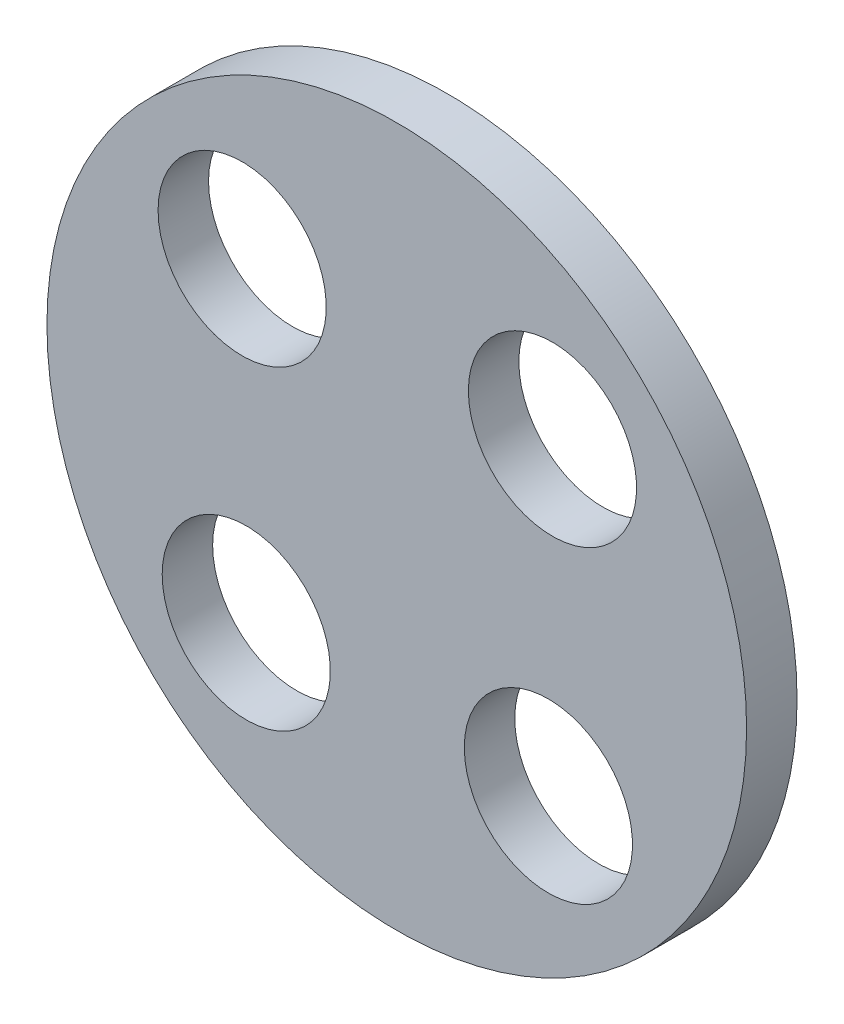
from build123d import *

# Parameters (mm, degrees)
SKETCH1_R          = 26.416
EXTRUDE1_DEPTH     = 3.81
SKETCH2_R          = 6.35
CUT_EXTRUDE1_DEPTH = 38.551647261


with BuildPart() as part:
    # Sketch1 → Extrude1 (new body)
    with BuildSketch(Plane.XY):
        with Locations(Location((0, 0, 0), (0, 0, 180))):
            Circle(SKETCH1_R)
    extrude(amount=EXTRUDE1_DEPTH)

    # Sketch2 → Cut-Extrude1 (cut, through all)
    with BuildSketch(Plane.XY):
        with Locations(Location((-11.674332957, 11.674332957, 0), (0, 0, 180))):
            Circle(SKETCH2_R)
        with Locations(Location((11.756888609, 11.591189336, 0), (0, 0, 180))):
            Circle(SKETCH2_R)
        with Locations(Location((11.448903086, -11.895491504, 0), (0, 0, 180))):
            Circle(SKETCH2_R)
        with Locations(Location((-11.364280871, -11.976360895, 0), (0, 0, 180))):
            Circle(SKETCH2_R)
    extrude(amount=CUT_EXTRUDE1_DEPTH, mode=Mode.SUBTRACT)


solid = part.part
